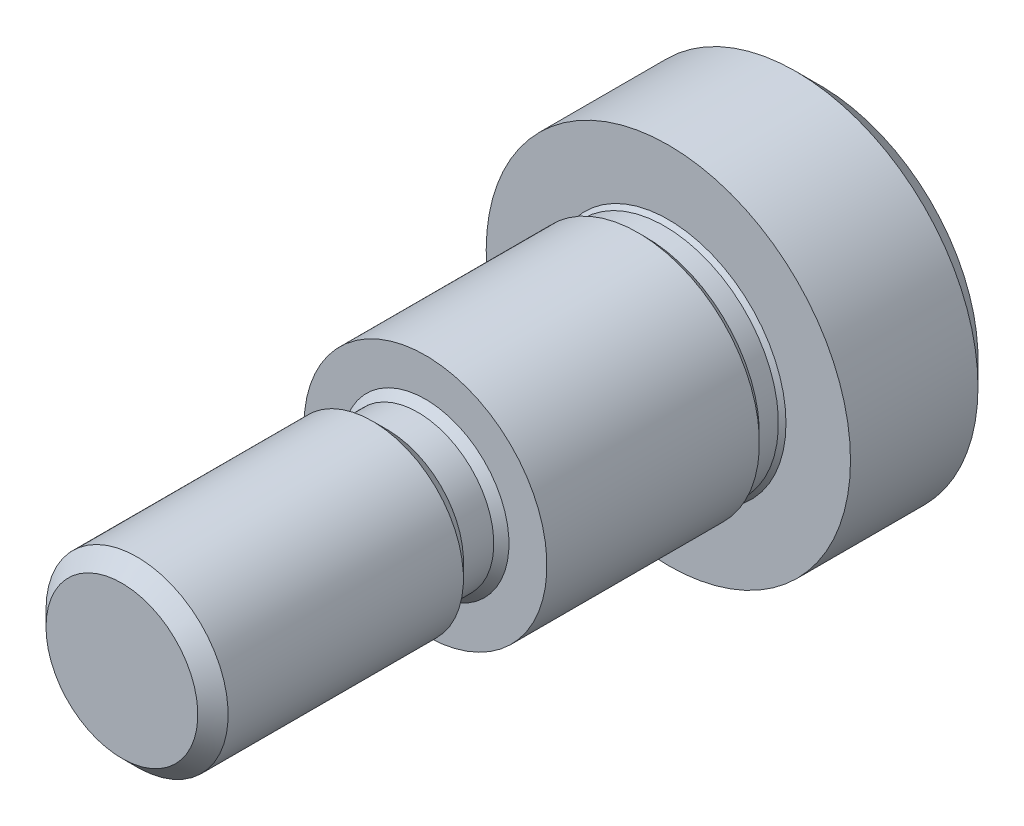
from build123d import *

# Parameters (mm, degrees)
CUT_EXTRUDE1_DEPTH = 5.291666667


with BuildPart() as part:
    # Logo3_bib1 → Revolve1 (revolve)
    with BuildSketch(Plane(origin=(0, 0, 0), x_dir=(-1, 0, 0), z_dir=(0, -1, 0))):
        Polygon((6.35, 0), (4.365625, 0), (3.96875, -0.396875), (3.96875, -1.984375), (4.7625, -2.778125), (4.7625, -15.08125), (3.96875, -15.875), (0, -15.875), (0, 20.6375), (8.255, 20.6375), (9.525, 19.3675), (9.525, 12.7), (6.1515625, 12.7), (5.953125, 12.5015625), (5.953125, 11.509375), (6.35, 11.1125), align=None)
    revolve(axis=Axis((0, 0, -62.352722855), (0, 0, 1)))

    # Logo3_bib2 → Cut-Extrude1 (cut)
    with BuildSketch(Plane(origin=(0, 0, -20.6375), x_dir=(1, 0, 0), z_dir=(0, 0, -1))):
        Polygon((3.666174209, 0), (1.833087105, 3.175), (-1.833087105, 3.175), (-3.666174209, 0), (-1.833087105, -3.175), (1.833087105, -3.175), align=None)
    extrude(amount=-CUT_EXTRUDE1_DEPTH, mode=Mode.SUBTRACT)


solid = part.part
